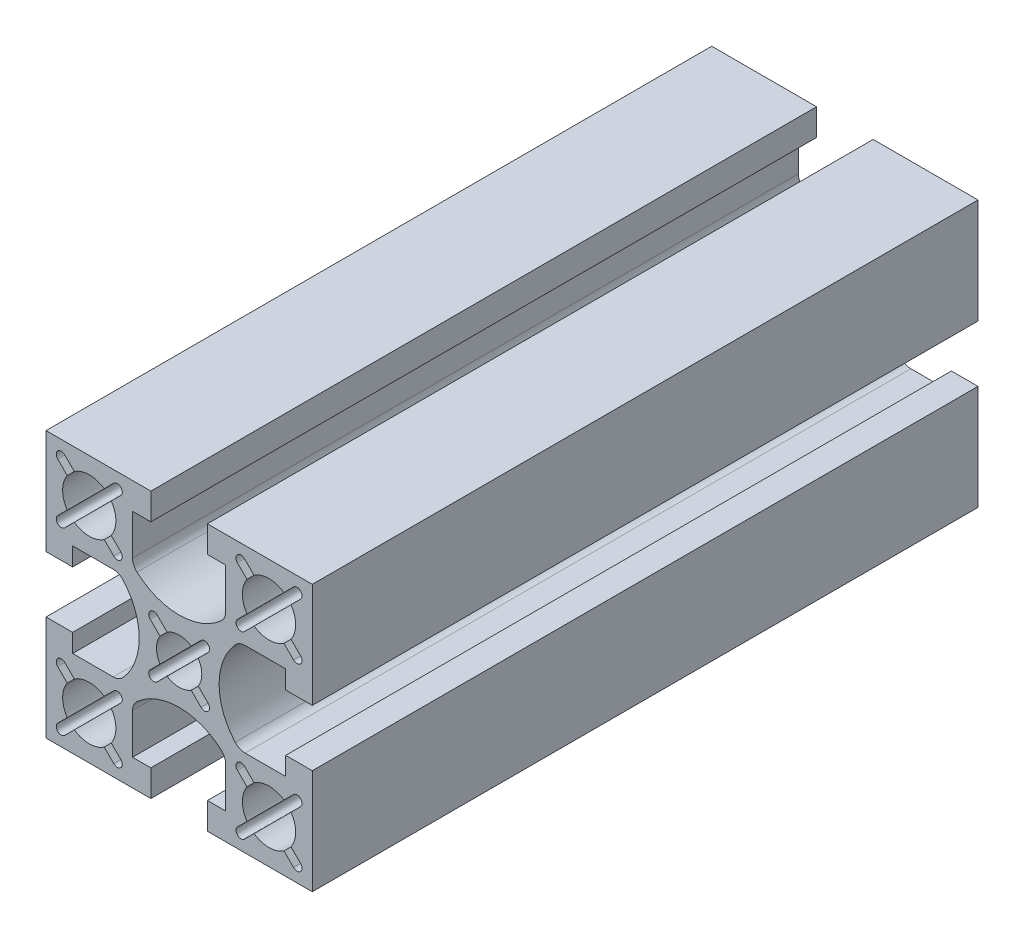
from build123d import *

# Parameters (mm, degrees)
SKETCH_1_W                      = 40
SKETCH_1_H                      = 40
EXTRUDE_1_DEPTH                 = 50
SKETCH_2_R                      = 3.4
CUT_EXTRUDE_1_DEPTH             = 104.923048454
SKETCH_3_R                      = 4
CUT_EXTRUDE_2_DEPTH             = 104.923048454
PATTERN_CIRCULAR_1_COUNT        = 4
CUT_EXTRUDE_3_DEPTH             = 104.923048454
PATTERN_CIRCULAR_2_COUNT        = 4
CUT_EXTRUDE_4_DEPTH             = 104.923048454
PATTERN_CIRCULAR_3_COUNT        = 4
PATTERN_CIRCULAR_4_COUNT        = 4
PATTERN_CIRCULAR_4_COPY_1_DEPTH = 104.923048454
PATTERN_CIRCULAR_4_COPY_2_DEPTH = 104.923048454
PATTERN_CIRCULAR_4_COPY_3_DEPTH = 104.923048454
PATTERN_CIRCULAR_4_COPY_4_DEPTH = 104.923048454
PATTERN_CIRCULAR_4_COPY_5_DEPTH = 104.923048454
PATTERN_CIRCULAR_4_COPY_6_DEPTH = 104.923048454
PATTERN_CIRCULAR_4_COPY_7_DEPTH = 104.923048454
PATTERN_CIRCULAR_4_COPY_8_DEPTH = 104.923048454
PATTERN_CIRCULAR_4_COPY_9_DEPTH = 104.923048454
CUT_EXTRUDE_5_DEPTH             = 104.923048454
PATTERN_CIRCULAR_5_COUNT        = 4


with BuildPart() as part:
    # Sketch 1 → Extrude 1 (new, symmetric)
    with BuildSketch(Plane.XY):
        Rectangle(SKETCH_1_W, SKETCH_1_H)
    extrude(amount=EXTRUDE_1_DEPTH, both=True)

    # Sketch 2 → Cut-Extrude 1 (cut, through all)
    with BuildSketch(Plane.XY.offset(50)):
        Circle(SKETCH_2_R)
    extrude(amount=-CUT_EXTRUDE_1_DEPTH, mode=Mode.SUBTRACT)

    # Sketch 3 → Cut-Extrude 2 (cut, through all)
    with BuildSketch(Plane.XY.offset(50)):
        with Locations((-13.5, 13.5)):
            Circle(SKETCH_3_R)
    cut_extrude_2 = extrude(amount=-CUT_EXTRUDE_2_DEPTH, mode=Mode.SUBTRACT)

    # Pattern Circular 1: Cut-Extrude 2 ×4 about axis
    pattern_circular_1_axis = Axis((0, 0, 0), (0, 0, 1))
    for i in range(1, PATTERN_CIRCULAR_1_COUNT):
        add(cut_extrude_2.rotate(pattern_circular_1_axis, i * 360 / PATTERN_CIRCULAR_1_COUNT), mode=Mode.SUBTRACT)

    # Sketch 4 → Cut-Extrude 3 (cut, through all)
    with BuildSketch(Plane.XY.offset(50)):
        with BuildLine():
            Line((4.25, 20), (-4.25, 20))
            Line((-4.25, 20), (-4.25, 16))
            Line((-4.25, 16), (-7, 16))
            Line((-7, 16), (-7, 9.909830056))
            ThreePointArc((-7, 9.909830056), (-6.825741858, 9.093333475), (-6.333333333, 8.419118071))
            ThreePointArc((-6.333333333, 8.419118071), (0, 6), (6.333333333, 8.419118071))
            ThreePointArc((6.333333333, 8.419118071), (6.825741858, 9.093333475), (7, 9.909830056))
            Line((7, 9.909830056), (7, 16))
            Line((7, 16), (4.25, 16))
            Line((4.25, 16), (4.25, 20))
        make_face()
    cut_extrude_3 = extrude(amount=-CUT_EXTRUDE_3_DEPTH, mode=Mode.SUBTRACT)

    # Pattern Circular 2: Cut-Extrude 3 ×4 about axis
    pattern_circular_2_axis = Axis((0, 0, 0), (0, 0, 1))
    for i in range(1, PATTERN_CIRCULAR_2_COUNT):
        add(cut_extrude_3.rotate(pattern_circular_2_axis, i * 360 / PATTERN_CIRCULAR_2_COUNT), mode=Mode.SUBTRACT)

    # Sketch 5 → Cut-Extrude 4 (cut, through all)
    with BuildSketch(Plane.XY.offset(50)):
        with BuildLine():
            Line((-15.74793376, 16.808593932), (-17.179034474, 18.239694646))
            ThreePointArc((-17.179034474, 18.239694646), (-18.239694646, 18.239694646), (-18.239694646, 17.179034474))
            Line((-18.239694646, 17.179034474), (-16.808593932, 15.74793376))
            ThreePointArc((-16.808593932, 15.74793376), (-16.328427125, 16.328427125), (-15.74793376, 16.808593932))
        make_face()
    cut_extrude_4 = extrude(amount=-CUT_EXTRUDE_4_DEPTH, mode=Mode.SUBTRACT)

    # Pattern Circular 3: Cut-Extrude 4 ×4 about axis
    pattern_circular_3_axis = Axis((-13.5, 13.5, 0), (0, 0, 1))
    for i in range(1, PATTERN_CIRCULAR_3_COUNT):
        add(cut_extrude_4.rotate(pattern_circular_3_axis, i * 360 / PATTERN_CIRCULAR_3_COUNT), mode=Mode.SUBTRACT)

    # Pattern Circular 4: Cut-Extrude 4 ×4 about axis
    pattern_circular_4_axis = Axis((0, 0, 0), (0, 0, 1))
    for i in range(1, PATTERN_CIRCULAR_4_COUNT):
        add(cut_extrude_4.rotate(pattern_circular_4_axis, i * 360 / PATTERN_CIRCULAR_4_COUNT), mode=Mode.SUBTRACT)

    # Pattern Circular 4 copy 1 sketch → Pattern Circular 4 copy 1 (cut, through all)
    with BuildSketch(Plane(origin=(-27, 0, 50), x_dir=(-1, 0, 0), z_dir=(0, 0, 1))):
        with BuildLine():
            Line((-15.74793376, 16.808593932), (-17.179034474, 18.239694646))
            ThreePointArc((-17.179034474, 18.239694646), (-18.239694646, 18.239694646), (-18.239694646, 17.179034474))
            Line((-18.239694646, 17.179034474), (-16.808593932, 15.74793376))
            ThreePointArc((-16.808593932, 15.74793376), (-16.328427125, 16.328427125), (-15.74793376, 16.808593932))
        make_face()
    extrude(amount=-PATTERN_CIRCULAR_4_COPY_1_DEPTH, mode=Mode.SUBTRACT)

    # Pattern Circular 4 copy 2 sketch → Pattern Circular 4 copy 2 (cut, through all)
    with BuildSketch(Plane(origin=(0, -27, 50), x_dir=(0, -1, 0), z_dir=(0, 0, 1))):
        with BuildLine():
            Line((-15.74793376, 16.808593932), (-17.179034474, 18.239694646))
            ThreePointArc((-17.179034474, 18.239694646), (-18.239694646, 18.239694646), (-18.239694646, 17.179034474))
            Line((-18.239694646, 17.179034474), (-16.808593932, 15.74793376))
            ThreePointArc((-16.808593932, 15.74793376), (-16.328427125, 16.328427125), (-15.74793376, 16.808593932))
        make_face()
    extrude(amount=-PATTERN_CIRCULAR_4_COPY_2_DEPTH, mode=Mode.SUBTRACT)

    # Pattern Circular 4 copy 3 sketch → Pattern Circular 4 copy 3 (cut, through all)
    with BuildSketch(Plane(origin=(27, 0, 50), x_dir=(1, 0, 0), z_dir=(0, 0, 1))):
        with BuildLine():
            Line((-15.74793376, 16.808593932), (-17.179034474, 18.239694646))
            ThreePointArc((-17.179034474, 18.239694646), (-18.239694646, 18.239694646), (-18.239694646, 17.179034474))
            Line((-18.239694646, 17.179034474), (-16.808593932, 15.74793376))
            ThreePointArc((-16.808593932, 15.74793376), (-16.328427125, 16.328427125), (-15.74793376, 16.808593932))
        make_face()
    extrude(amount=-PATTERN_CIRCULAR_4_COPY_3_DEPTH, mode=Mode.SUBTRACT)

    # Pattern Circular 4 copy 4 sketch → Pattern Circular 4 copy 4 (cut, through all)
    with BuildSketch(Plane(origin=(-27, -27, 50), x_dir=(0, -1, 0), z_dir=(0, 0, 1))):
        with BuildLine():
            Line((-15.74793376, 16.808593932), (-17.179034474, 18.239694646))
            ThreePointArc((-17.179034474, 18.239694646), (-18.239694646, 18.239694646), (-18.239694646, 17.179034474))
            Line((-18.239694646, 17.179034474), (-16.808593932, 15.74793376))
            ThreePointArc((-16.808593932, 15.74793376), (-16.328427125, 16.328427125), (-15.74793376, 16.808593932))
        make_face()
    extrude(amount=-PATTERN_CIRCULAR_4_COPY_4_DEPTH, mode=Mode.SUBTRACT)

    # Pattern Circular 4 copy 5 sketch → Pattern Circular 4 copy 5 (cut, through all)
    with BuildSketch(Plane(origin=(27, -27, 50), x_dir=(1, 0, 0), z_dir=(0, 0, 1))):
        with BuildLine():
            Line((-15.74793376, 16.808593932), (-17.179034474, 18.239694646))
            ThreePointArc((-17.179034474, 18.239694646), (-18.239694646, 18.239694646), (-18.239694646, 17.179034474))
            Line((-18.239694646, 17.179034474), (-16.808593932, 15.74793376))
            ThreePointArc((-16.808593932, 15.74793376), (-16.328427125, 16.328427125), (-15.74793376, 16.808593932))
        make_face()
    extrude(amount=-PATTERN_CIRCULAR_4_COPY_5_DEPTH, mode=Mode.SUBTRACT)

    # Pattern Circular 4 copy 6 sketch → Pattern Circular 4 copy 6 (cut, through all)
    with BuildSketch(Plane(origin=(27, 27, 50), x_dir=(0, 1, 0), z_dir=(0, 0, 1))):
        with BuildLine():
            Line((-15.74793376, 16.808593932), (-17.179034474, 18.239694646))
            ThreePointArc((-17.179034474, 18.239694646), (-18.239694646, 18.239694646), (-18.239694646, 17.179034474))
            Line((-18.239694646, 17.179034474), (-16.808593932, 15.74793376))
            ThreePointArc((-16.808593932, 15.74793376), (-16.328427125, 16.328427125), (-15.74793376, 16.808593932))
        make_face()
    extrude(amount=-PATTERN_CIRCULAR_4_COPY_6_DEPTH, mode=Mode.SUBTRACT)

    # Pattern Circular 4 copy 7 sketch → Pattern Circular 4 copy 7 (cut, through all)
    with BuildSketch(Plane(origin=(0, -27, 50), x_dir=(1, 0, 0), z_dir=(0, 0, 1))):
        with BuildLine():
            Line((-15.74793376, 16.808593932), (-17.179034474, 18.239694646))
            ThreePointArc((-17.179034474, 18.239694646), (-18.239694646, 18.239694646), (-18.239694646, 17.179034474))
            Line((-18.239694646, 17.179034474), (-16.808593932, 15.74793376))
            ThreePointArc((-16.808593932, 15.74793376), (-16.328427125, 16.328427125), (-15.74793376, 16.808593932))
        make_face()
    extrude(amount=-PATTERN_CIRCULAR_4_COPY_7_DEPTH, mode=Mode.SUBTRACT)

    # Pattern Circular 4 copy 8 sketch → Pattern Circular 4 copy 8 (cut, through all)
    with BuildSketch(Plane(origin=(27, 0, 50), x_dir=(0, 1, 0), z_dir=(0, 0, 1))):
        with BuildLine():
            Line((-15.74793376, 16.808593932), (-17.179034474, 18.239694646))
            ThreePointArc((-17.179034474, 18.239694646), (-18.239694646, 18.239694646), (-18.239694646, 17.179034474))
            Line((-18.239694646, 17.179034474), (-16.808593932, 15.74793376))
            ThreePointArc((-16.808593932, 15.74793376), (-16.328427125, 16.328427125), (-15.74793376, 16.808593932))
        make_face()
    extrude(amount=-PATTERN_CIRCULAR_4_COPY_8_DEPTH, mode=Mode.SUBTRACT)

    # Pattern Circular 4 copy 9 sketch → Pattern Circular 4 copy 9 (cut, through all)
    with BuildSketch(Plane(origin=(0, 27, 50), x_dir=(-1, 0, 0), z_dir=(0, 0, 1))):
        with BuildLine():
            Line((-15.74793376, 16.808593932), (-17.179034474, 18.239694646))
            ThreePointArc((-17.179034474, 18.239694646), (-18.239694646, 18.239694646), (-18.239694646, 17.179034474))
            Line((-18.239694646, 17.179034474), (-16.808593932, 15.74793376))
            ThreePointArc((-16.808593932, 15.74793376), (-16.328427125, 16.328427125), (-15.74793376, 16.808593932))
        make_face()
    extrude(amount=-PATTERN_CIRCULAR_4_COPY_9_DEPTH, mode=Mode.SUBTRACT)

    # Sketch 6 → Cut-Extrude 5 (cut, through all)
    with BuildSketch(Plane.XY.offset(50)):
        with BuildLine():
            Line((-4.348706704, 3.288046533), (-2.87527145, 1.814611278))
            ThreePointArc((-2.87527145, 1.814611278), (-2.404163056, 2.404163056), (-1.814611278, 2.87527145))
            Line((-1.814611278, 2.87527145), (-3.288046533, 4.348706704))
            ThreePointArc((-3.288046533, 4.348706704), (-4.348706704, 4.348706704), (-4.348706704, 3.288046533))
        make_face()
    cut_extrude_5 = extrude(amount=-CUT_EXTRUDE_5_DEPTH, mode=Mode.SUBTRACT)

    # Pattern Circular 5: Cut-Extrude 5 ×4 about axis
    pattern_circular_5_axis = Axis((0, 0, 0), (0, 0, 1))
    for i in range(1, PATTERN_CIRCULAR_5_COUNT):
        add(cut_extrude_5.rotate(pattern_circular_5_axis, i * 360 / PATTERN_CIRCULAR_5_COUNT), mode=Mode.SUBTRACT)


solid = part.part
